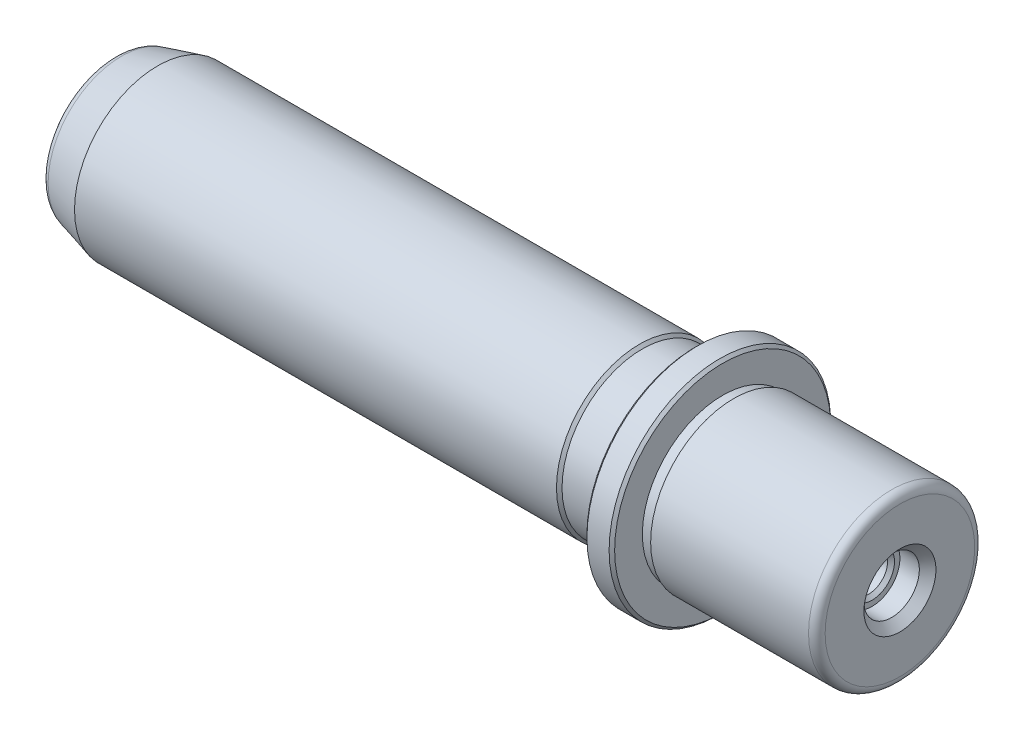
ISO-10303-21;
HEADER;
FILE_DESCRIPTION(('STEP AP214'),'2;1');
FILE_NAME('part.step','',(''),(''),'','','');
FILE_SCHEMA(('AUTOMOTIVE_DESIGN { 1 0 10303 214 1 1 1 1 }'));
ENDSEC;
DATA;
#1=APPLICATION_CONTEXT('core data for automotive mechanical design processes');
#2=APPLICATION_PROTOCOL_DEFINITION('international standard','automotive_design',2000,#1);
#3=PRODUCT_CONTEXT('',#1,'mechanical');
#4=PRODUCT('Part','Part','',(#3));
#5=PRODUCT_RELATED_PRODUCT_CATEGORY('part','',(#4));
#6=PRODUCT_DEFINITION_FORMATION('','',#4);
#7=PRODUCT_DEFINITION_CONTEXT('part definition',#1,'design');
#8=PRODUCT_DEFINITION('design','',#6,#7);
#9=PRODUCT_DEFINITION_SHAPE('','',#8);
#10=(LENGTH_UNIT() NAMED_UNIT(*) SI_UNIT(.MILLI.,.METRE.));
#11=(NAMED_UNIT(*) PLANE_ANGLE_UNIT() SI_UNIT($,.RADIAN.));
#12=(NAMED_UNIT(*) SI_UNIT($,.STERADIAN.) SOLID_ANGLE_UNIT());
#13=UNCERTAINTY_MEASURE_WITH_UNIT(LENGTH_MEASURE(1.E-05),#10,'distance_accuracy_value','');
#14=(GEOMETRIC_REPRESENTATION_CONTEXT(3) GLOBAL_UNCERTAINTY_ASSIGNED_CONTEXT((#13)) GLOBAL_UNIT_ASSIGNED_CONTEXT((#10,
#11,#12)) REPRESENTATION_CONTEXT('',''));
#15=CARTESIAN_POINT('',(0.,0.,0.));
#16=DIRECTION('',(0.,0.,1.));
#17=DIRECTION('',(1.,0.,0.));
#18=AXIS2_PLACEMENT_3D('',#15,#16,#17);
#19=CARTESIAN_POINT('',(110.,0.,0.));
#20=DIRECTION('',(-1.,0.,0.));
#21=DIRECTION('',(0.,0.,1.));
#22=AXIS2_PLACEMENT_3D('',#19,#20,#21);
#23=CONICAL_SURFACE('',#22,19.5,0.785398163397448);
#24=CARTESIAN_POINT('',(109.5,0.,0.));
#25=DIRECTION('',(-1.,0.,0.));
#26=DIRECTION('',(0.,0.,1.));
#27=AXIS2_PLACEMENT_3D('',#24,#25,#26);
#28=CIRCLE('',#27,20.);
#29=CARTESIAN_POINT('',(109.5,0.,20.));
#30=VERTEX_POINT('',#29);
#31=EDGE_CURVE('E77',#30,#30,#28,.T.);
#32=ORIENTED_EDGE('',*,*,#31,.F.);
#33=EDGE_LOOP('',(#32));
#34=FACE_BOUND('',#33,.T.);
#35=CARTESIAN_POINT('',(110.,0.,0.));
#36=DIRECTION('',(-1.,0.,0.));
#37=DIRECTION('',(0.,0.,1.));
#38=AXIS2_PLACEMENT_3D('',#35,#36,#37);
#39=CIRCLE('',#38,19.5);
#40=CARTESIAN_POINT('',(110.,0.,19.5));
#41=VERTEX_POINT('',#40);
#42=EDGE_CURVE('E11',#41,#41,#39,.T.);
#43=ORIENTED_EDGE('',*,*,#42,.T.);
#44=EDGE_LOOP('',(#43));
#45=FACE_BOUND('',#44,.T.);
#46=ADVANCED_FACE('F38',(#34,#45),#23,.T.);
#47=CARTESIAN_POINT('',(110.,19.5,0.));
#48=DIRECTION('',(-1.,0.,0.));
#49=DIRECTION('',(0.,0.,1.));
#50=AXIS2_PLACEMENT_3D('',#47,#48,#49);
#51=PLANE('',#50);
#52=ORIENTED_EDGE('',*,*,#42,.F.);
#53=EDGE_LOOP('',(#52));
#54=FACE_BOUND('',#53,.T.);
#55=CARTESIAN_POINT('',(110.,0.,0.));
#56=DIRECTION('',(-1.,0.,0.));
#57=DIRECTION('',(0.,0.,1.));
#58=AXIS2_PLACEMENT_3D('',#55,#56,#57);
#59=CIRCLE('',#58,14.5);
#60=CARTESIAN_POINT('',(110.,0.,14.5));
#61=VERTEX_POINT('',#60);
#62=EDGE_CURVE('E45',#61,#61,#59,.T.);
#63=ORIENTED_EDGE('',*,*,#62,.T.);
#64=EDGE_LOOP('',(#63));
#65=FACE_BOUND('',#64,.T.);
#66=ADVANCED_FACE('F139',(#54,#65),#51,.F.);
#67=CARTESIAN_POINT('',(0.,0.,0.));
#68=DIRECTION('',(-1.,0.,0.));
#69=DIRECTION('',(0.,0.,1.));
#70=AXIS2_PLACEMENT_3D('',#67,#68,#69);
#71=CYLINDRICAL_SURFACE('',#70,14.5);
#72=ORIENTED_EDGE('',*,*,#62,.F.);
#73=EDGE_LOOP('',(#72));
#74=FACE_BOUND('',#73,.T.);
#75=CARTESIAN_POINT('',(112.,0.,0.));
#76=DIRECTION('',(-1.,0.,0.));
#77=DIRECTION('',(0.,0.,1.));
#78=AXIS2_PLACEMENT_3D('',#75,#76,#77);
#79=CIRCLE('',#78,14.5);
#80=CARTESIAN_POINT('',(112.,0.,14.5));
#81=VERTEX_POINT('',#80);
#82=EDGE_CURVE('E134',#81,#81,#79,.T.);
#83=ORIENTED_EDGE('',*,*,#82,.T.);
#84=EDGE_LOOP('',(#83));
#85=FACE_BOUND('',#84,.T.);
#86=ADVANCED_FACE('F141',(#74,#85),#71,.T.);
#87=CARTESIAN_POINT('',(112.,14.5,0.));
#88=DIRECTION('',(1.,0.,0.));
#89=DIRECTION('',(0.,0.,-1.));
#90=AXIS2_PLACEMENT_3D('',#87,#88,#89);
#91=PLANE('',#90);
#92=ORIENTED_EDGE('',*,*,#82,.F.);
#93=EDGE_LOOP('',(#92));
#94=FACE_BOUND('',#93,.T.);
#95=CARTESIAN_POINT('',(112.,0.,0.));
#96=DIRECTION('',(-1.,0.,0.));
#97=DIRECTION('',(0.,0.,1.));
#98=AXIS2_PLACEMENT_3D('',#95,#96,#97);
#99=CIRCLE('',#98,15.);
#100=CARTESIAN_POINT('',(112.,0.,15.));
#101=VERTEX_POINT('',#100);
#102=EDGE_CURVE('E131',#101,#101,#99,.T.);
#103=ORIENTED_EDGE('',*,*,#102,.T.);
#104=EDGE_LOOP('',(#103));
#105=FACE_BOUND('',#104,.T.);
#106=ADVANCED_FACE('F144',(#94,#105),#91,.F.);
#107=CARTESIAN_POINT('',(0.,0.,0.));
#108=DIRECTION('',(-1.,0.,0.));
#109=DIRECTION('',(0.,0.,1.));
#110=AXIS2_PLACEMENT_3D('',#107,#108,#109);
#111=CYLINDRICAL_SURFACE('',#110,15.);
#112=ORIENTED_EDGE('',*,*,#102,.F.);
#113=EDGE_LOOP('',(#112));
#114=FACE_BOUND('',#113,.T.);
#115=CARTESIAN_POINT('',(140.5,0.,0.));
#116=DIRECTION('',(-1.,0.,0.));
#117=DIRECTION('',(0.,0.,1.));
#118=AXIS2_PLACEMENT_3D('',#115,#116,#117);
#119=CIRCLE('',#118,15.);
#120=CARTESIAN_POINT('',(140.5,0.,15.));
#121=VERTEX_POINT('',#120);
#122=EDGE_CURVE('E128',#121,#121,#119,.T.);
#123=ORIENTED_EDGE('',*,*,#122,.T.);
#124=EDGE_LOOP('',(#123));
#125=FACE_BOUND('',#124,.T.);
#126=ADVANCED_FACE('F150',(#114,#125),#111,.T.);
#127=CARTESIAN_POINT('',(140.5,0.,0.));
#128=DIRECTION('',(-1.,0.,0.));
#129=DIRECTION('',(0.,0.,1.));
#130=AXIS2_PLACEMENT_3D('',#127,#128,#129);
#131=TOROIDAL_SURFACE('',#130,13.5,1.5);
#132=ORIENTED_EDGE('',*,*,#122,.F.);
#133=EDGE_LOOP('',(#132));
#134=FACE_BOUND('',#133,.T.);
#135=CARTESIAN_POINT('',(142.,0.,0.));
#136=DIRECTION('',(-1.,0.,0.));
#137=DIRECTION('',(0.,0.,1.));
#138=AXIS2_PLACEMENT_3D('',#135,#136,#137);
#139=CIRCLE('',#138,13.5);
#140=CARTESIAN_POINT('',(142.,0.,13.5));
#141=VERTEX_POINT('',#140);
#142=EDGE_CURVE('E125',#141,#141,#139,.T.);
#143=ORIENTED_EDGE('',*,*,#142,.T.);
#144=EDGE_LOOP('',(#143));
#145=FACE_BOUND('',#144,.T.);
#146=ADVANCED_FACE('F156',(#134,#145),#131,.T.);
#147=CARTESIAN_POINT('',(142.,13.5,0.));
#148=DIRECTION('',(-1.,0.,0.));
#149=DIRECTION('',(0.,0.,1.));
#150=AXIS2_PLACEMENT_3D('',#147,#148,#149);
#151=PLANE('',#150);
#152=ORIENTED_EDGE('',*,*,#142,.F.);
#153=EDGE_LOOP('',(#152));
#154=FACE_BOUND('',#153,.T.);
#155=CARTESIAN_POINT('',(142.,0.,0.));
#156=DIRECTION('',(-1.,0.,0.));
#157=DIRECTION('',(0.,0.,1.));
#158=AXIS2_PLACEMENT_3D('',#155,#156,#157);
#159=CIRCLE('',#158,6.50000000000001);
#160=CARTESIAN_POINT('',(142.,0.,6.50000000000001));
#161=VERTEX_POINT('',#160);
#162=EDGE_CURVE('E122',#161,#161,#159,.T.);
#163=ORIENTED_EDGE('',*,*,#162,.T.);
#164=EDGE_LOOP('',(#163));
#165=FACE_BOUND('',#164,.T.);
#166=ADVANCED_FACE('F162',(#154,#165),#151,.F.);
#167=CARTESIAN_POINT('',(140.5,0.,0.));
#168=DIRECTION('',(1.,0.,0.));
#169=DIRECTION('',(0.,0.,-1.));
#170=AXIS2_PLACEMENT_3D('',#167,#168,#169);
#171=CONICAL_SURFACE('',#170,5.,0.785398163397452);
#172=ORIENTED_EDGE('',*,*,#162,.F.);
#173=EDGE_LOOP('',(#172));
#174=FACE_BOUND('',#173,.T.);
#175=CARTESIAN_POINT('',(140.5,0.,0.));
#176=DIRECTION('',(-1.,0.,0.));
#177=DIRECTION('',(0.,0.,1.));
#178=AXIS2_PLACEMENT_3D('',#175,#176,#177);
#179=CIRCLE('',#178,5.);
#180=CARTESIAN_POINT('',(140.5,0.,5.));
#181=VERTEX_POINT('',#180);
#182=EDGE_CURVE('E119',#181,#181,#179,.T.);
#183=ORIENTED_EDGE('',*,*,#182,.T.);
#184=EDGE_LOOP('',(#183));
#185=FACE_BOUND('',#184,.T.);
#186=ADVANCED_FACE('F168',(#174,#185),#171,.F.);
#187=CARTESIAN_POINT('',(0.,0.,0.));
#188=DIRECTION('',(-1.,0.,0.));
#189=DIRECTION('',(0.,0.,1.));
#190=AXIS2_PLACEMENT_3D('',#187,#188,#189);
#191=CYLINDRICAL_SURFACE('',#190,5.);
#192=ORIENTED_EDGE('',*,*,#182,.F.);
#193=EDGE_LOOP('',(#192));
#194=FACE_BOUND('',#193,.T.);
#195=CARTESIAN_POINT('',(137.,0.,0.));
#196=DIRECTION('',(-1.,0.,0.));
#197=DIRECTION('',(0.,0.,1.));
#198=AXIS2_PLACEMENT_3D('',#195,#196,#197);
#199=CIRCLE('',#198,5.);
#200=CARTESIAN_POINT('',(137.,0.,5.));
#201=VERTEX_POINT('',#200);
#202=EDGE_CURVE('E116',#201,#201,#199,.T.);
#203=ORIENTED_EDGE('',*,*,#202,.T.);
#204=EDGE_LOOP('',(#203));
#205=FACE_BOUND('',#204,.T.);
#206=ADVANCED_FACE('F174',(#194,#205),#191,.F.);
#207=CARTESIAN_POINT('',(137.,5.,0.));
#208=DIRECTION('',(-1.,0.,0.));
#209=DIRECTION('',(0.,0.,1.));
#210=AXIS2_PLACEMENT_3D('',#207,#208,#209);
#211=PLANE('',#210);
#212=CARTESIAN_POINT('',(137.,0.,0.));
#213=DIRECTION('',(1.,0.,0.));
#214=DIRECTION('',(0.,0.,-1.));
#215=AXIS2_PLACEMENT_3D('',#212,#213,#214);
#216=CIRCLE('',#215,4.025);
#217=CARTESIAN_POINT('',(137.,0.,-4.025));
#218=VERTEX_POINT('',#217);
#219=EDGE_CURVE('E61',#218,#218,#216,.T.);
#220=ORIENTED_EDGE('',*,*,#219,.F.);
#221=EDGE_LOOP('',(#220));
#222=FACE_BOUND('',#221,.T.);
#223=ORIENTED_EDGE('',*,*,#202,.F.);
#224=EDGE_LOOP('',(#223));
#225=FACE_BOUND('',#224,.T.);
#226=ADVANCED_FACE('F180',(#222,#225),#211,.F.);
#227=CARTESIAN_POINT('',(5.,5.,0.));
#228=DIRECTION('',(1.,0.,0.));
#229=DIRECTION('',(0.,0.,-1.));
#230=AXIS2_PLACEMENT_3D('',#227,#228,#229);
#231=PLANE('',#230);
#232=CARTESIAN_POINT('',(5.,0.,0.));
#233=DIRECTION('',(-1.,0.,0.));
#234=DIRECTION('',(0.,0.,1.));
#235=AXIS2_PLACEMENT_3D('',#232,#233,#234);
#236=CIRCLE('',#235,4.025);
#237=CARTESIAN_POINT('',(5.,0.,4.025));
#238=VERTEX_POINT('',#237);
#239=EDGE_CURVE('E68',#238,#238,#236,.T.);
#240=ORIENTED_EDGE('',*,*,#239,.F.);
#241=EDGE_LOOP('',(#240));
#242=FACE_BOUND('',#241,.T.);
#243=CARTESIAN_POINT('',(5.,0.,0.));
#244=DIRECTION('',(-1.,0.,0.));
#245=DIRECTION('',(0.,0.,1.));
#246=AXIS2_PLACEMENT_3D('',#243,#244,#245);
#247=CIRCLE('',#246,5.);
#248=CARTESIAN_POINT('',(5.,0.,5.));
#249=VERTEX_POINT('',#248);
#250=EDGE_CURVE('E113',#249,#249,#247,.T.);
#251=ORIENTED_EDGE('',*,*,#250,.T.);
#252=EDGE_LOOP('',(#251));
#253=FACE_BOUND('',#252,.T.);
#254=ADVANCED_FACE('F185',(#242,#253),#231,.F.);
#255=CARTESIAN_POINT('',(0.,0.,0.));
#256=DIRECTION('',(-1.,0.,0.));
#257=DIRECTION('',(0.,0.,1.));
#258=AXIS2_PLACEMENT_3D('',#255,#256,#257);
#259=CYLINDRICAL_SURFACE('',#258,5.);
#260=ORIENTED_EDGE('',*,*,#250,.F.);
#261=EDGE_LOOP('',(#260));
#262=FACE_BOUND('',#261,.T.);
#263=CARTESIAN_POINT('',(1.5,0.,0.));
#264=DIRECTION('',(-1.,0.,0.));
#265=DIRECTION('',(0.,0.,1.));
#266=AXIS2_PLACEMENT_3D('',#263,#264,#265);
#267=CIRCLE('',#266,5.);
#268=CARTESIAN_POINT('',(1.5,0.,5.));
#269=VERTEX_POINT('',#268);
#270=EDGE_CURVE('E110',#269,#269,#267,.T.);
#271=ORIENTED_EDGE('',*,*,#270,.T.);
#272=EDGE_LOOP('',(#271));
#273=FACE_BOUND('',#272,.T.);
#274=ADVANCED_FACE('F191',(#262,#273),#259,.F.);
#275=CARTESIAN_POINT('',(0.,0.,0.));
#276=DIRECTION('',(-1.,0.,0.));
#277=DIRECTION('',(0.,0.,1.));
#278=AXIS2_PLACEMENT_3D('',#275,#276,#277);
#279=CONICAL_SURFACE('',#278,6.50000000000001,0.78539816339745);
#280=ORIENTED_EDGE('',*,*,#270,.F.);
#281=EDGE_LOOP('',(#280));
#282=FACE_BOUND('',#281,.T.);
#283=CARTESIAN_POINT('',(0.,0.,0.));
#284=DIRECTION('',(-1.,0.,0.));
#285=DIRECTION('',(0.,0.,1.));
#286=AXIS2_PLACEMENT_3D('',#283,#284,#285);
#287=CIRCLE('',#286,6.50000000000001);
#288=CARTESIAN_POINT('',(0.,0.,6.50000000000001));
#289=VERTEX_POINT('',#288);
#290=EDGE_CURVE('E107',#289,#289,#287,.T.);
#291=ORIENTED_EDGE('',*,*,#290,.T.);
#292=EDGE_LOOP('',(#291));
#293=FACE_BOUND('',#292,.T.);
#294=ADVANCED_FACE('F253',(#282,#293),#279,.F.);
#295=CARTESIAN_POINT('',(0.,6.50000000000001,0.));
#296=DIRECTION('',(1.,0.,0.));
#297=DIRECTION('',(0.,0.,-1.));
#298=AXIS2_PLACEMENT_3D('',#295,#296,#297);
#299=PLANE('',#298);
#300=ORIENTED_EDGE('',*,*,#290,.F.);
#301=EDGE_LOOP('',(#300));
#302=FACE_BOUND('',#301,.T.);
#303=CARTESIAN_POINT('',(0.,0.,0.));
#304=DIRECTION('',(-1.,0.,0.));
#305=DIRECTION('',(0.,0.,1.));
#306=AXIS2_PLACEMENT_3D('',#303,#304,#305);
#307=CIRCLE('',#306,11.3217524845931);
#308=CARTESIAN_POINT('',(0.,0.,11.3217524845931));
#309=VERTEX_POINT('',#308);
#310=EDGE_CURVE('E104',#309,#309,#307,.T.);
#311=ORIENTED_EDGE('',*,*,#310,.T.);
#312=EDGE_LOOP('',(#311));
#313=FACE_BOUND('',#312,.T.);
#314=ADVANCED_FACE('F249',(#302,#313),#299,.F.);
#315=CARTESIAN_POINT('',(2.,0.,0.));
#316=DIRECTION('',(-1.,0.,0.));
#317=DIRECTION('',(0.,0.,1.));
#318=AXIS2_PLACEMENT_3D('',#315,#316,#317);
#319=TOROIDAL_SURFACE('',#318,11.3217524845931,2.);
#320=ORIENTED_EDGE('',*,*,#310,.F.);
#321=EDGE_LOOP('',(#320));
#322=FACE_BOUND('',#321,.T.);
#323=CARTESIAN_POINT('',(1.48236190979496,0.,0.));
#324=DIRECTION('',(-1.,0.,0.));
#325=DIRECTION('',(0.,0.,1.));
#326=AXIS2_PLACEMENT_3D('',#323,#324,#325);
#327=CIRCLE('',#326,13.2536041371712);
#328=CARTESIAN_POINT('',(1.48236190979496,0.,13.2536041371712));
#329=VERTEX_POINT('',#328);
#330=EDGE_CURVE('E101',#329,#329,#327,.T.);
#331=ORIENTED_EDGE('',*,*,#330,.T.);
#332=EDGE_LOOP('',(#331));
#333=FACE_BOUND('',#332,.T.);
#334=ADVANCED_FACE('F245',(#322,#333),#319,.T.);
#335=CARTESIAN_POINT('',(8.,0.,0.));
#336=DIRECTION('',(1.,0.,0.));
#337=DIRECTION('',(0.,0.,-1.));
#338=AXIS2_PLACEMENT_3D('',#335,#336,#337);
#339=CONICAL_SURFACE('',#338,15.,0.26179938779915);
#340=ORIENTED_EDGE('',*,*,#330,.F.);
#341=EDGE_LOOP('',(#340));
#342=FACE_BOUND('',#341,.T.);
#343=CARTESIAN_POINT('',(8.,0.,0.));
#344=DIRECTION('',(-1.,0.,0.));
#345=DIRECTION('',(0.,0.,1.));
#346=AXIS2_PLACEMENT_3D('',#343,#344,#345);
#347=CIRCLE('',#346,15.);
#348=CARTESIAN_POINT('',(8.,0.,15.));
#349=VERTEX_POINT('',#348);
#350=EDGE_CURVE('E98',#349,#349,#347,.T.);
#351=ORIENTED_EDGE('',*,*,#350,.T.);
#352=EDGE_LOOP('',(#351));
#353=FACE_BOUND('',#352,.T.);
#354=ADVANCED_FACE('F241',(#342,#353),#339,.T.);
#355=CARTESIAN_POINT('',(0.,0.,0.));
#356=DIRECTION('',(-1.,0.,0.));
#357=DIRECTION('',(0.,0.,1.));
#358=AXIS2_PLACEMENT_3D('',#355,#356,#357);
#359=CYLINDRICAL_SURFACE('',#358,15.);
#360=ORIENTED_EDGE('',*,*,#350,.F.);
#361=EDGE_LOOP('',(#360));
#362=FACE_BOUND('',#361,.T.);
#363=CARTESIAN_POINT('',(95.,0.,0.));
#364=DIRECTION('',(-1.,0.,0.));
#365=DIRECTION('',(0.,0.,1.));
#366=AXIS2_PLACEMENT_3D('',#363,#364,#365);
#367=CIRCLE('',#366,15.);
#368=CARTESIAN_POINT('',(95.,0.,15.));
#369=VERTEX_POINT('',#368);
#370=EDGE_CURVE('E95',#369,#369,#367,.T.);
#371=ORIENTED_EDGE('',*,*,#370,.T.);
#372=EDGE_LOOP('',(#371));
#373=FACE_BOUND('',#372,.T.);
#374=ADVANCED_FACE('F237',(#362,#373),#359,.T.);
#375=CARTESIAN_POINT('',(95.5,0.,0.));
#376=DIRECTION('',(-1.,0.,0.));
#377=DIRECTION('',(0.,0.,1.));
#378=AXIS2_PLACEMENT_3D('',#375,#376,#377);
#379=CONICAL_SURFACE('',#378,14.5,0.785398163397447);
#380=ORIENTED_EDGE('',*,*,#370,.F.);
#381=EDGE_LOOP('',(#380));
#382=FACE_BOUND('',#381,.T.);
#383=CARTESIAN_POINT('',(95.5,0.,0.));
#384=DIRECTION('',(-1.,0.,0.));
#385=DIRECTION('',(0.,0.,1.));
#386=AXIS2_PLACEMENT_3D('',#383,#384,#385);
#387=CIRCLE('',#386,14.5);
#388=CARTESIAN_POINT('',(95.5,0.,14.5));
#389=VERTEX_POINT('',#388);
#390=EDGE_CURVE('E92',#389,#389,#387,.T.);
#391=ORIENTED_EDGE('',*,*,#390,.T.);
#392=EDGE_LOOP('',(#391));
#393=FACE_BOUND('',#392,.T.);
#394=ADVANCED_FACE('F233',(#382,#393),#379,.T.);
#395=CARTESIAN_POINT('',(0.,0.,0.));
#396=DIRECTION('',(-1.,0.,0.));
#397=DIRECTION('',(0.,0.,1.));
#398=AXIS2_PLACEMENT_3D('',#395,#396,#397);
#399=CYLINDRICAL_SURFACE('',#398,14.5);
#400=ORIENTED_EDGE('',*,*,#390,.F.);
#401=EDGE_LOOP('',(#400));
#402=FACE_BOUND('',#401,.T.);
#403=CARTESIAN_POINT('',(104.5,0.,0.));
#404=DIRECTION('',(-1.,0.,0.));
#405=DIRECTION('',(0.,0.,1.));
#406=AXIS2_PLACEMENT_3D('',#403,#404,#405);
#407=CIRCLE('',#406,14.5);
#408=CARTESIAN_POINT('',(104.5,0.,14.5));
#409=VERTEX_POINT('',#408);
#410=EDGE_CURVE('E89',#409,#409,#407,.T.);
#411=ORIENTED_EDGE('',*,*,#410,.T.);
#412=EDGE_LOOP('',(#411));
#413=FACE_BOUND('',#412,.T.);
#414=ADVANCED_FACE('F229',(#402,#413),#399,.T.);
#415=CARTESIAN_POINT('',(105.,0.,0.));
#416=DIRECTION('',(1.,0.,0.));
#417=DIRECTION('',(0.,0.,-1.));
#418=AXIS2_PLACEMENT_3D('',#415,#416,#417);
#419=CONICAL_SURFACE('',#418,15.,0.785398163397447);
#420=ORIENTED_EDGE('',*,*,#410,.F.);
#421=EDGE_LOOP('',(#420));
#422=FACE_BOUND('',#421,.T.);
#423=CARTESIAN_POINT('',(105.,0.,0.));
#424=DIRECTION('',(-1.,0.,0.));
#425=DIRECTION('',(0.,0.,1.));
#426=AXIS2_PLACEMENT_3D('',#423,#424,#425);
#427=CIRCLE('',#426,15.);
#428=CARTESIAN_POINT('',(105.,0.,15.));
#429=VERTEX_POINT('',#428);
#430=EDGE_CURVE('E86',#429,#429,#427,.T.);
#431=ORIENTED_EDGE('',*,*,#430,.T.);
#432=EDGE_LOOP('',(#431));
#433=FACE_BOUND('',#432,.T.);
#434=ADVANCED_FACE('F225',(#422,#433),#419,.T.);
#435=CARTESIAN_POINT('',(105.,19.5,0.));
#436=DIRECTION('',(1.,0.,0.));
#437=DIRECTION('',(0.,0.,-1.));
#438=AXIS2_PLACEMENT_3D('',#435,#436,#437);
#439=PLANE('',#438);
#440=ORIENTED_EDGE('',*,*,#430,.F.);
#441=EDGE_LOOP('',(#440));
#442=FACE_BOUND('',#441,.T.);
#443=CARTESIAN_POINT('',(105.,0.,0.));
#444=DIRECTION('',(-1.,0.,0.));
#445=DIRECTION('',(0.,0.,1.));
#446=AXIS2_PLACEMENT_3D('',#443,#444,#445);
#447=CIRCLE('',#446,19.5);
#448=CARTESIAN_POINT('',(105.,0.,19.5));
#449=VERTEX_POINT('',#448);
#450=EDGE_CURVE('E83',#449,#449,#447,.T.);
#451=ORIENTED_EDGE('',*,*,#450,.T.);
#452=EDGE_LOOP('',(#451));
#453=FACE_BOUND('',#452,.T.);
#454=ADVANCED_FACE('F217',(#442,#453),#439,.F.);
#455=CARTESIAN_POINT('',(105.5,0.,0.));
#456=DIRECTION('',(1.,0.,0.));
#457=DIRECTION('',(0.,0.,-1.));
#458=AXIS2_PLACEMENT_3D('',#455,#456,#457);
#459=CONICAL_SURFACE('',#458,20.,0.785398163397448);
#460=ORIENTED_EDGE('',*,*,#450,.F.);
#461=EDGE_LOOP('',(#460));
#462=FACE_BOUND('',#461,.T.);
#463=CARTESIAN_POINT('',(105.5,0.,0.));
#464=DIRECTION('',(-1.,0.,0.));
#465=DIRECTION('',(0.,0.,1.));
#466=AXIS2_PLACEMENT_3D('',#463,#464,#465);
#467=CIRCLE('',#466,20.);
#468=CARTESIAN_POINT('',(105.5,0.,20.));
#469=VERTEX_POINT('',#468);
#470=EDGE_CURVE('E80',#469,#469,#467,.T.);
#471=ORIENTED_EDGE('',*,*,#470,.T.);
#472=EDGE_LOOP('',(#471));
#473=FACE_BOUND('',#472,.T.);
#474=ADVANCED_FACE('F208',(#462,#473),#459,.T.);
#475=CARTESIAN_POINT('',(0.,0.,0.));
#476=DIRECTION('',(-1.,0.,0.));
#477=DIRECTION('',(0.,0.,1.));
#478=AXIS2_PLACEMENT_3D('',#475,#476,#477);
#479=CYLINDRICAL_SURFACE('',#478,20.);
#480=ORIENTED_EDGE('',*,*,#470,.F.);
#481=EDGE_LOOP('',(#480));
#482=FACE_BOUND('',#481,.T.);
#483=ORIENTED_EDGE('',*,*,#31,.T.);
#484=EDGE_LOOP('',(#483));
#485=FACE_BOUND('',#484,.T.);
#486=ADVANCED_FACE('F205',(#482,#485),#479,.T.);
#487=CARTESIAN_POINT('',(114.75,0.,0.));
#488=DIRECTION('',(1.,0.,0.));
#489=DIRECTION('',(0.,0.,-1.));
#490=AXIS2_PLACEMENT_3D('',#487,#488,#489);
#491=CONICAL_SURFACE('',#490,3.39999999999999,1.02974425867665);
#492=CARTESIAN_POINT('',(112.707073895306,0.,0.));
#493=VERTEX_POINT('',#492);
#494=VERTEX_LOOP('',#493);
#495=FACE_BOUND('',#494,.T.);
#496=CARTESIAN_POINT('',(114.75,0.,0.));
#497=DIRECTION('',(1.,0.,0.));
#498=DIRECTION('',(0.,0.,-1.));
#499=AXIS2_PLACEMENT_3D('',#496,#497,#498);
#500=CIRCLE('',#499,3.39999999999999);
#501=CARTESIAN_POINT('',(114.75,0.,-3.39999999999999));
#502=VERTEX_POINT('',#501);
#503=EDGE_CURVE('E74',#502,#502,#500,.T.);
#504=ORIENTED_EDGE('',*,*,#503,.T.);
#505=EDGE_LOOP('',(#504));
#506=FACE_BOUND('',#505,.T.);
#507=ADVANCED_FACE('F207',(#495,#506),#491,.F.);
#508=CARTESIAN_POINT('',(137.,0.,0.));
#509=DIRECTION('',(1.,0.,0.));
#510=DIRECTION('',(0.,0.,-1.));
#511=AXIS2_PLACEMENT_3D('',#508,#509,#510);
#512=CYLINDRICAL_SURFACE('',#511,3.39999999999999);
#513=ORIENTED_EDGE('',*,*,#503,.F.);
#514=EDGE_LOOP('',(#513));
#515=FACE_BOUND('',#514,.T.);
#516=CARTESIAN_POINT('',(136.375,0.,0.));
#517=DIRECTION('',(1.,0.,0.));
#518=DIRECTION('',(0.,0.,-1.));
#519=AXIS2_PLACEMENT_3D('',#516,#517,#518);
#520=CIRCLE('',#519,3.39999999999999);
#521=CARTESIAN_POINT('',(136.375,0.,-3.39999999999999));
#522=VERTEX_POINT('',#521);
#523=EDGE_CURVE('E65',#522,#522,#520,.T.);
#524=ORIENTED_EDGE('',*,*,#523,.T.);
#525=EDGE_LOOP('',(#524));
#526=FACE_BOUND('',#525,.T.);
#527=ADVANCED_FACE('F215',(#515,#526),#512,.F.);
#528=CARTESIAN_POINT('',(137.,0.,0.));
#529=DIRECTION('',(1.,0.,0.));
#530=DIRECTION('',(0.,0.,-1.));
#531=AXIS2_PLACEMENT_3D('',#528,#529,#530);
#532=CONICAL_SURFACE('',#531,4.025,0.785398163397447);
#533=ORIENTED_EDGE('',*,*,#523,.F.);
#534=EDGE_LOOP('',(#533));
#535=FACE_BOUND('',#534,.T.);
#536=ORIENTED_EDGE('',*,*,#219,.T.);
#537=EDGE_LOOP('',(#536));
#538=FACE_BOUND('',#537,.T.);
#539=ADVANCED_FACE('F55',(#535,#538),#532,.F.);
#540=CARTESIAN_POINT('',(27.25,0.,0.));
#541=DIRECTION('',(-1.,0.,0.));
#542=DIRECTION('',(0.,0.,1.));
#543=AXIS2_PLACEMENT_3D('',#540,#541,#542);
#544=CONICAL_SURFACE('',#543,3.39999999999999,1.02974425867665);
#545=CARTESIAN_POINT('',(29.2929261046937,0.,0.));
#546=VERTEX_POINT('',#545);
#547=VERTEX_LOOP('',#546);
#548=FACE_BOUND('',#547,.T.);
#549=CARTESIAN_POINT('',(27.25,0.,0.));
#550=DIRECTION('',(-1.,0.,0.));
#551=DIRECTION('',(0.,0.,1.));
#552=AXIS2_PLACEMENT_3D('',#549,#550,#551);
#553=CIRCLE('',#552,3.39999999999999);
#554=CARTESIAN_POINT('',(27.25,0.,3.39999999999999));
#555=VERTEX_POINT('',#554);
#556=EDGE_CURVE('E59',#555,#555,#553,.T.);
#557=ORIENTED_EDGE('',*,*,#556,.T.);
#558=EDGE_LOOP('',(#557));
#559=FACE_BOUND('',#558,.T.);
#560=ADVANCED_FACE('F51',(#548,#559),#544,.F.);
#561=CARTESIAN_POINT('',(5.,0.,0.));
#562=DIRECTION('',(-1.,0.,0.));
#563=DIRECTION('',(0.,0.,1.));
#564=AXIS2_PLACEMENT_3D('',#561,#562,#563);
#565=CYLINDRICAL_SURFACE('',#564,3.39999999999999);
#566=ORIENTED_EDGE('',*,*,#556,.F.);
#567=EDGE_LOOP('',(#566));
#568=FACE_BOUND('',#567,.T.);
#569=CARTESIAN_POINT('',(5.62500000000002,0.,0.));
#570=DIRECTION('',(-1.,0.,0.));
#571=DIRECTION('',(0.,0.,1.));
#572=AXIS2_PLACEMENT_3D('',#569,#570,#571);
#573=CIRCLE('',#572,3.39999999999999);
#574=CARTESIAN_POINT('',(5.62500000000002,0.,3.39999999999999));
#575=VERTEX_POINT('',#574);
#576=EDGE_CURVE('E62',#575,#575,#573,.T.);
#577=ORIENTED_EDGE('',*,*,#576,.T.);
#578=EDGE_LOOP('',(#577));
#579=FACE_BOUND('',#578,.T.);
#580=ADVANCED_FACE('F54',(#568,#579),#565,.F.);
#581=CARTESIAN_POINT('',(5.,0.,0.));
#582=DIRECTION('',(-1.,0.,0.));
#583=DIRECTION('',(0.,0.,1.));
#584=AXIS2_PLACEMENT_3D('',#581,#582,#583);
#585=CONICAL_SURFACE('',#584,4.025,0.785398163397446);
#586=ORIENTED_EDGE('',*,*,#576,.F.);
#587=EDGE_LOOP('',(#586));
#588=FACE_BOUND('',#587,.T.);
#589=ORIENTED_EDGE('',*,*,#239,.T.);
#590=EDGE_LOOP('',(#589));
#591=FACE_BOUND('',#590,.T.);
#592=ADVANCED_FACE('F390',(#588,#591),#585,.F.);
#593=CLOSED_SHELL('',(#46,#66,#86,#106,#126,#146,#166,#186,#206,#226,#254,#274,#294,#314,#334,
#354,#374,#394,#414,#434,#454,#474,#486,#507,#527,#539,#560,#580,#592));
#594=MANIFOLD_SOLID_BREP('B2',#593);
#595=ADVANCED_BREP_SHAPE_REPRESENTATION('',(#18,#594),#14);
#596=SHAPE_DEFINITION_REPRESENTATION(#9,#595);
ENDSEC;
END-ISO-10303-21;
